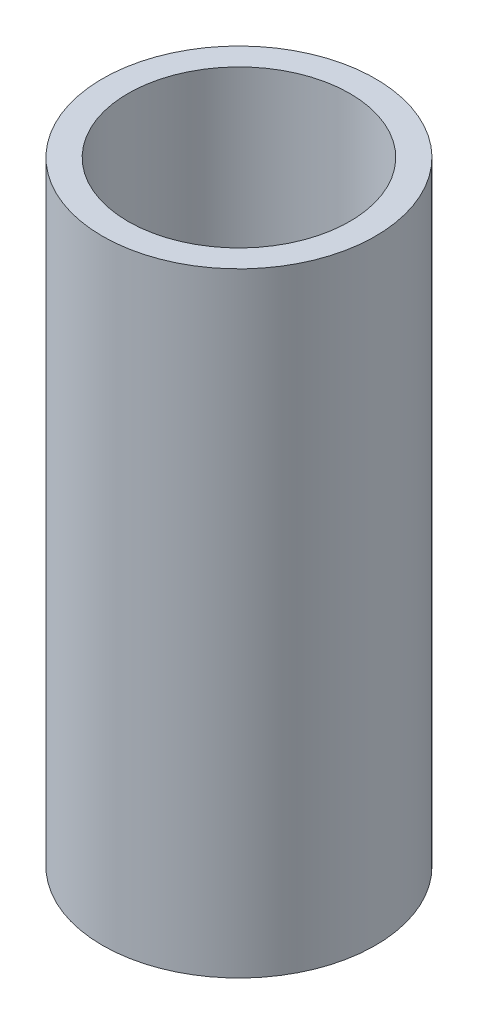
from build123d import *

# Parameters (mm, degrees)
SKETCH1_R      = 4
SKETCH1_R_2    = 3.25
EXTRUDE1_DEPTH = 18


with BuildPart() as part:
    # Sketch1 → Extrude1 (new body)
    with BuildSketch(Plane(origin=(0, 0, 0), x_dir=(1, 0, 0), z_dir=(0, 1, 0))):
        with Locations(Location((0, 0, 0), (0, 0, 270))):
            Circle(SKETCH1_R)
        with Locations(Location((0, 0, 0), (0, 0, 270))):
            Circle(SKETCH1_R_2, mode=Mode.SUBTRACT)
    extrude(amount=EXTRUDE1_DEPTH)


solid = part.part
